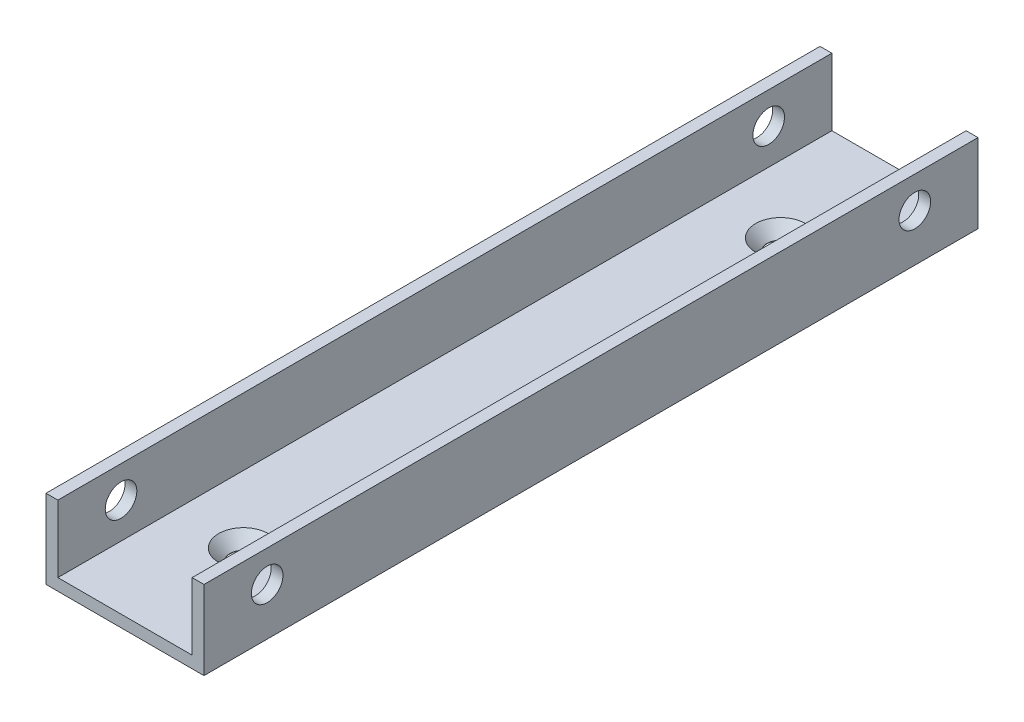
ISO-10303-21;
HEADER;
FILE_DESCRIPTION(('STEP AP214'),'2;1');
FILE_NAME('part.step','',(''),(''),'','','');
FILE_SCHEMA(('AUTOMOTIVE_DESIGN { 1 0 10303 214 1 1 1 1 }'));
ENDSEC;
DATA;
#1=APPLICATION_CONTEXT('core data for automotive mechanical design processes');
#2=APPLICATION_PROTOCOL_DEFINITION('international standard','automotive_design',2000,#1);
#3=PRODUCT_CONTEXT('',#1,'mechanical');
#4=PRODUCT('Part','Part','',(#3));
#5=PRODUCT_RELATED_PRODUCT_CATEGORY('part','',(#4));
#6=PRODUCT_DEFINITION_FORMATION('','',#4);
#7=PRODUCT_DEFINITION_CONTEXT('part definition',#1,'design');
#8=PRODUCT_DEFINITION('design','',#6,#7);
#9=PRODUCT_DEFINITION_SHAPE('','',#8);
#10=(LENGTH_UNIT() NAMED_UNIT(*) SI_UNIT(.MILLI.,.METRE.));
#11=(NAMED_UNIT(*) PLANE_ANGLE_UNIT() SI_UNIT($,.RADIAN.));
#12=(NAMED_UNIT(*) SI_UNIT($,.STERADIAN.) SOLID_ANGLE_UNIT());
#13=UNCERTAINTY_MEASURE_WITH_UNIT(LENGTH_MEASURE(1.E-05),#10,'distance_accuracy_value','');
#14=(GEOMETRIC_REPRESENTATION_CONTEXT(3) GLOBAL_UNCERTAINTY_ASSIGNED_CONTEXT((#13)) GLOBAL_UNIT_ASSIGNED_CONTEXT((#10,
#11,#12)) REPRESENTATION_CONTEXT('',''));
#15=CARTESIAN_POINT('',(0.,0.,0.));
#16=DIRECTION('',(0.,0.,1.));
#17=DIRECTION('',(1.,0.,0.));
#18=AXIS2_PLACEMENT_3D('',#15,#16,#17);
#19=CARTESIAN_POINT('',(-10.,0.,-98.));
#20=DIRECTION('',(-1.,0.,0.));
#21=DIRECTION('',(0.,0.,1.));
#22=AXIS2_PLACEMENT_3D('',#19,#20,#21);
#23=PLANE('',#22);
#24=CARTESIAN_POINT('',(-10.,6.,-90.));
#25=DIRECTION('',(-1.,0.,0.));
#26=DIRECTION('',(0.,0.,1.));
#27=AXIS2_PLACEMENT_3D('',#24,#25,#26);
#28=CIRCLE('',#27,2.);
#29=CARTESIAN_POINT('',(-10.,6.,-88.));
#30=VERTEX_POINT('',#29);
#31=EDGE_CURVE('E202',#30,#30,#28,.T.);
#32=ORIENTED_EDGE('',*,*,#31,.F.);
#33=EDGE_LOOP('',(#32));
#34=FACE_BOUND('',#33,.T.);
#35=CARTESIAN_POINT('',(-10.,6.,-8.00000000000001));
#36=DIRECTION('',(-1.,0.,0.));
#37=DIRECTION('',(0.,0.,1.));
#38=AXIS2_PLACEMENT_3D('',#35,#36,#37);
#39=CIRCLE('',#38,2.);
#40=CARTESIAN_POINT('',(-10.,6.,-6.00000000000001));
#41=VERTEX_POINT('',#40);
#42=EDGE_CURVE('E205',#41,#41,#39,.T.);
#43=ORIENTED_EDGE('',*,*,#42,.F.);
#44=EDGE_LOOP('',(#43));
#45=FACE_BOUND('',#44,.T.);
#46=DIRECTION('',(0.,-1.,0.));
#47=VECTOR('',#46,1.);
#48=CARTESIAN_POINT('',(-10.,0.,0.));
#49=LINE('',#48,#47);
#50=CARTESIAN_POINT('',(-10.,10.,0.));
#51=VERTEX_POINT('',#50);
#52=CARTESIAN_POINT('',(-10.,0.,0.));
#53=VERTEX_POINT('',#52);
#54=EDGE_CURVE('E91',#51,#53,#49,.T.);
#55=ORIENTED_EDGE('',*,*,#54,.F.);
#56=DIRECTION('',(0.,0.,1.));
#57=VECTOR('',#56,1.);
#58=CARTESIAN_POINT('',(-10.,10.,-98.));
#59=LINE('',#58,#57);
#60=CARTESIAN_POINT('',(-10.,10.,-98.));
#61=VERTEX_POINT('',#60);
#62=EDGE_CURVE('E11',#61,#51,#59,.T.);
#63=ORIENTED_EDGE('',*,*,#62,.F.);
#64=DIRECTION('',(0.,-1.,0.));
#65=VECTOR('',#64,1.);
#66=CARTESIAN_POINT('',(-10.,0.,-98.));
#67=LINE('',#66,#65);
#68=CARTESIAN_POINT('',(-10.,0.,-98.));
#69=VERTEX_POINT('',#68);
#70=EDGE_CURVE('E93',#61,#69,#67,.T.);
#71=ORIENTED_EDGE('',*,*,#70,.T.);
#72=DIRECTION('',(0.,0.,1.));
#73=VECTOR('',#72,1.);
#74=CARTESIAN_POINT('',(-10.,0.,-98.));
#75=LINE('',#74,#73);
#76=EDGE_CURVE('E88',#69,#53,#75,.T.);
#77=ORIENTED_EDGE('',*,*,#76,.T.);
#78=EDGE_LOOP('',(#55,#63,#71,#77));
#79=FACE_BOUND('',#78,.T.);
#80=ADVANCED_FACE('F26',(#34,#45,#79),#23,.T.);
#81=CARTESIAN_POINT('',(-10.,10.,-98.));
#82=DIRECTION('',(0.,1.,0.));
#83=DIRECTION('',(0.,0.,1.));
#84=AXIS2_PLACEMENT_3D('',#81,#82,#83);
#85=PLANE('',#84);
#86=DIRECTION('',(-1.,0.,0.));
#87=VECTOR('',#86,1.);
#88=CARTESIAN_POINT('',(-10.,10.,0.));
#89=LINE('',#88,#87);
#90=CARTESIAN_POINT('',(-8.5,10.,0.));
#91=VERTEX_POINT('',#90);
#92=EDGE_CURVE('E110',#91,#51,#89,.T.);
#93=ORIENTED_EDGE('',*,*,#92,.F.);
#94=DIRECTION('',(0.,0.,1.));
#95=VECTOR('',#94,1.);
#96=CARTESIAN_POINT('',(-8.5,10.,-98.));
#97=LINE('',#96,#95);
#98=CARTESIAN_POINT('',(-8.5,10.,-98.));
#99=VERTEX_POINT('',#98);
#100=EDGE_CURVE('E34',#99,#91,#97,.T.);
#101=ORIENTED_EDGE('',*,*,#100,.F.);
#102=DIRECTION('',(-1.,0.,0.));
#103=VECTOR('',#102,1.);
#104=CARTESIAN_POINT('',(-10.,10.,-98.));
#105=LINE('',#104,#103);
#106=EDGE_CURVE('E98',#99,#61,#105,.T.);
#107=ORIENTED_EDGE('',*,*,#106,.T.);
#108=ORIENTED_EDGE('',*,*,#62,.T.);
#109=EDGE_LOOP('',(#93,#101,#107,#108));
#110=FACE_BOUND('',#109,.T.);
#111=ADVANCED_FACE('F177',(#110),#85,.T.);
#112=CARTESIAN_POINT('',(-8.5,1.5,-98.));
#113=DIRECTION('',(1.,0.,0.));
#114=DIRECTION('',(0.,0.,-1.));
#115=AXIS2_PLACEMENT_3D('',#112,#113,#114);
#116=PLANE('',#115);
#117=CARTESIAN_POINT('',(-8.5,6.,-90.));
#118=DIRECTION('',(1.,0.,0.));
#119=DIRECTION('',(0.,0.,-1.));
#120=AXIS2_PLACEMENT_3D('',#117,#118,#119);
#121=CIRCLE('',#120,2.);
#122=CARTESIAN_POINT('',(-8.5,6.,-92.));
#123=VERTEX_POINT('',#122);
#124=EDGE_CURVE('E208',#123,#123,#121,.T.);
#125=ORIENTED_EDGE('',*,*,#124,.F.);
#126=EDGE_LOOP('',(#125));
#127=FACE_BOUND('',#126,.T.);
#128=CARTESIAN_POINT('',(-8.5,6.,-8.00000000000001));
#129=DIRECTION('',(1.,0.,0.));
#130=DIRECTION('',(0.,0.,-1.));
#131=AXIS2_PLACEMENT_3D('',#128,#129,#130);
#132=CIRCLE('',#131,2.);
#133=CARTESIAN_POINT('',(-8.5,6.,-10.));
#134=VERTEX_POINT('',#133);
#135=EDGE_CURVE('E220',#134,#134,#132,.T.);
#136=ORIENTED_EDGE('',*,*,#135,.F.);
#137=EDGE_LOOP('',(#136));
#138=FACE_BOUND('',#137,.T.);
#139=DIRECTION('',(0.,1.,0.));
#140=VECTOR('',#139,1.);
#141=CARTESIAN_POINT('',(-8.5,1.5,0.));
#142=LINE('',#141,#140);
#143=CARTESIAN_POINT('',(-8.5,1.5,0.));
#144=VERTEX_POINT('',#143);
#145=EDGE_CURVE('E128',#144,#91,#142,.T.);
#146=ORIENTED_EDGE('',*,*,#145,.F.);
#147=DIRECTION('',(0.,0.,1.));
#148=VECTOR('',#147,1.);
#149=CARTESIAN_POINT('',(-8.5,1.5,-98.));
#150=LINE('',#149,#148);
#151=CARTESIAN_POINT('',(-8.5,1.5,-98.));
#152=VERTEX_POINT('',#151);
#153=EDGE_CURVE('E150',#152,#144,#150,.T.);
#154=ORIENTED_EDGE('',*,*,#153,.F.);
#155=DIRECTION('',(0.,1.,0.));
#156=VECTOR('',#155,1.);
#157=CARTESIAN_POINT('',(-8.5,1.5,-98.));
#158=LINE('',#157,#156);
#159=EDGE_CURVE('E146',#152,#99,#158,.T.);
#160=ORIENTED_EDGE('',*,*,#159,.T.);
#161=ORIENTED_EDGE('',*,*,#100,.T.);
#162=EDGE_LOOP('',(#146,#154,#160,#161));
#163=FACE_BOUND('',#162,.T.);
#164=ADVANCED_FACE('F176',(#127,#138,#163),#116,.T.);
#165=CARTESIAN_POINT('',(8.5,1.5,-98.));
#166=DIRECTION('',(0.,1.,0.));
#167=DIRECTION('',(0.,0.,1.));
#168=AXIS2_PLACEMENT_3D('',#165,#166,#167);
#169=PLANE('',#168);
#170=CARTESIAN_POINT('',(0.,1.5,-83.));
#171=DIRECTION('',(0.,1.,0.));
#172=DIRECTION('',(0.,0.,1.));
#173=AXIS2_PLACEMENT_3D('',#170,#171,#172);
#174=CIRCLE('',#173,3.15);
#175=CARTESIAN_POINT('',(0.,1.5,-79.85));
#176=VERTEX_POINT('',#175);
#177=EDGE_CURVE('E226',#176,#176,#174,.T.);
#178=ORIENTED_EDGE('',*,*,#177,.F.);
#179=EDGE_LOOP('',(#178));
#180=FACE_BOUND('',#179,.T.);
#181=CARTESIAN_POINT('',(0.,1.5,-15.));
#182=DIRECTION('',(0.,1.,0.));
#183=DIRECTION('',(0.,0.,1.));
#184=AXIS2_PLACEMENT_3D('',#181,#182,#183);
#185=CIRCLE('',#184,3.15);
#186=CARTESIAN_POINT('',(0.,1.5,-11.85));
#187=VERTEX_POINT('',#186);
#188=EDGE_CURVE('E114',#187,#187,#185,.T.);
#189=ORIENTED_EDGE('',*,*,#188,.F.);
#190=EDGE_LOOP('',(#189));
#191=FACE_BOUND('',#190,.T.);
#192=DIRECTION('',(-1.,0.,0.));
#193=VECTOR('',#192,1.);
#194=CARTESIAN_POINT('',(8.5,1.5,0.));
#195=LINE('',#194,#193);
#196=CARTESIAN_POINT('',(8.5,1.5,0.));
#197=VERTEX_POINT('',#196);
#198=EDGE_CURVE('E125',#197,#144,#195,.T.);
#199=ORIENTED_EDGE('',*,*,#198,.F.);
#200=DIRECTION('',(0.,0.,1.));
#201=VECTOR('',#200,1.);
#202=CARTESIAN_POINT('',(8.5,1.5,-98.));
#203=LINE('',#202,#201);
#204=CARTESIAN_POINT('',(8.5,1.5,-98.));
#205=VERTEX_POINT('',#204);
#206=EDGE_CURVE('E152',#205,#197,#203,.T.);
#207=ORIENTED_EDGE('',*,*,#206,.F.);
#208=DIRECTION('',(-1.,0.,0.));
#209=VECTOR('',#208,1.);
#210=CARTESIAN_POINT('',(8.5,1.5,-98.));
#211=LINE('',#210,#209);
#212=EDGE_CURVE('E143',#205,#152,#211,.T.);
#213=ORIENTED_EDGE('',*,*,#212,.T.);
#214=ORIENTED_EDGE('',*,*,#153,.T.);
#215=EDGE_LOOP('',(#199,#207,#213,#214));
#216=FACE_BOUND('',#215,.T.);
#217=ADVANCED_FACE('F172',(#180,#191,#216),#169,.T.);
#218=CARTESIAN_POINT('',(8.5,1.5,-98.));
#219=DIRECTION('',(-1.,0.,0.));
#220=DIRECTION('',(0.,0.,1.));
#221=AXIS2_PLACEMENT_3D('',#218,#219,#220);
#222=PLANE('',#221);
#223=CARTESIAN_POINT('',(8.5,6.,-90.));
#224=DIRECTION('',(-1.,0.,0.));
#225=DIRECTION('',(0.,0.,1.));
#226=AXIS2_PLACEMENT_3D('',#223,#224,#225);
#227=CIRCLE('',#226,2.);
#228=CARTESIAN_POINT('',(8.5,6.,-88.));
#229=VERTEX_POINT('',#228);
#230=EDGE_CURVE('E214',#229,#229,#227,.T.);
#231=ORIENTED_EDGE('',*,*,#230,.F.);
#232=EDGE_LOOP('',(#231));
#233=FACE_BOUND('',#232,.T.);
#234=CARTESIAN_POINT('',(8.5,6.,-8.00000000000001));
#235=DIRECTION('',(-1.,0.,0.));
#236=DIRECTION('',(0.,0.,1.));
#237=AXIS2_PLACEMENT_3D('',#234,#235,#236);
#238=CIRCLE('',#237,2.);
#239=CARTESIAN_POINT('',(8.5,6.,-6.00000000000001));
#240=VERTEX_POINT('',#239);
#241=EDGE_CURVE('E211',#240,#240,#238,.T.);
#242=ORIENTED_EDGE('',*,*,#241,.F.);
#243=EDGE_LOOP('',(#242));
#244=FACE_BOUND('',#243,.T.);
#245=DIRECTION('',(0.,-1.,0.));
#246=VECTOR('',#245,1.);
#247=CARTESIAN_POINT('',(8.5,1.5,0.));
#248=LINE('',#247,#246);
#249=CARTESIAN_POINT('',(8.5,10.,0.));
#250=VERTEX_POINT('',#249);
#251=EDGE_CURVE('E122',#250,#197,#248,.T.);
#252=ORIENTED_EDGE('',*,*,#251,.F.);
#253=DIRECTION('',(0.,0.,1.));
#254=VECTOR('',#253,1.);
#255=CARTESIAN_POINT('',(8.5,10.,-98.));
#256=LINE('',#255,#254);
#257=CARTESIAN_POINT('',(8.5,10.,-98.));
#258=VERTEX_POINT('',#257);
#259=EDGE_CURVE('E154',#258,#250,#256,.T.);
#260=ORIENTED_EDGE('',*,*,#259,.F.);
#261=DIRECTION('',(0.,-1.,0.));
#262=VECTOR('',#261,1.);
#263=CARTESIAN_POINT('',(8.5,1.5,-98.));
#264=LINE('',#263,#262);
#265=EDGE_CURVE('E140',#258,#205,#264,.T.);
#266=ORIENTED_EDGE('',*,*,#265,.T.);
#267=ORIENTED_EDGE('',*,*,#206,.T.);
#268=EDGE_LOOP('',(#252,#260,#266,#267));
#269=FACE_BOUND('',#268,.T.);
#270=ADVANCED_FACE('F168',(#233,#244,#269),#222,.T.);
#271=CARTESIAN_POINT('',(10.,10.,-98.));
#272=DIRECTION('',(0.,1.,0.));
#273=DIRECTION('',(0.,0.,1.));
#274=AXIS2_PLACEMENT_3D('',#271,#272,#273);
#275=PLANE('',#274);
#276=DIRECTION('',(-1.,0.,0.));
#277=VECTOR('',#276,1.);
#278=CARTESIAN_POINT('',(10.,10.,0.));
#279=LINE('',#278,#277);
#280=CARTESIAN_POINT('',(10.,10.,0.));
#281=VERTEX_POINT('',#280);
#282=EDGE_CURVE('E119',#281,#250,#279,.T.);
#283=ORIENTED_EDGE('',*,*,#282,.F.);
#284=DIRECTION('',(0.,0.,1.));
#285=VECTOR('',#284,1.);
#286=CARTESIAN_POINT('',(10.,10.,-98.));
#287=LINE('',#286,#285);
#288=CARTESIAN_POINT('',(10.,10.,-98.));
#289=VERTEX_POINT('',#288);
#290=EDGE_CURVE('E156',#289,#281,#287,.T.);
#291=ORIENTED_EDGE('',*,*,#290,.F.);
#292=DIRECTION('',(-1.,0.,0.));
#293=VECTOR('',#292,1.);
#294=CARTESIAN_POINT('',(10.,10.,-98.));
#295=LINE('',#294,#293);
#296=EDGE_CURVE('E137',#289,#258,#295,.T.);
#297=ORIENTED_EDGE('',*,*,#296,.T.);
#298=ORIENTED_EDGE('',*,*,#259,.T.);
#299=EDGE_LOOP('',(#283,#291,#297,#298));
#300=FACE_BOUND('',#299,.T.);
#301=ADVANCED_FACE('F164',(#300),#275,.T.);
#302=CARTESIAN_POINT('',(10.,0.,-98.));
#303=DIRECTION('',(1.,0.,0.));
#304=DIRECTION('',(0.,0.,-1.));
#305=AXIS2_PLACEMENT_3D('',#302,#303,#304);
#306=PLANE('',#305);
#307=CARTESIAN_POINT('',(10.,6.,-90.));
#308=DIRECTION('',(-1.,0.,0.));
#309=DIRECTION('',(0.,0.,1.));
#310=AXIS2_PLACEMENT_3D('',#307,#308,#309);
#311=CIRCLE('',#310,2.);
#312=CARTESIAN_POINT('',(10.,6.,-88.));
#313=VERTEX_POINT('',#312);
#314=EDGE_CURVE('E275',#313,#313,#311,.T.);
#315=ORIENTED_EDGE('',*,*,#314,.T.);
#316=EDGE_LOOP('',(#315));
#317=FACE_BOUND('',#316,.T.);
#318=CARTESIAN_POINT('',(10.,6.,-8.00000000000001));
#319=DIRECTION('',(-1.,0.,0.));
#320=DIRECTION('',(0.,0.,1.));
#321=AXIS2_PLACEMENT_3D('',#318,#319,#320);
#322=CIRCLE('',#321,2.);
#323=CARTESIAN_POINT('',(10.,6.,-6.00000000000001));
#324=VERTEX_POINT('',#323);
#325=EDGE_CURVE('E207',#324,#324,#322,.T.);
#326=ORIENTED_EDGE('',*,*,#325,.T.);
#327=EDGE_LOOP('',(#326));
#328=FACE_BOUND('',#327,.T.);
#329=DIRECTION('',(0.,1.,0.));
#330=VECTOR('',#329,1.);
#331=CARTESIAN_POINT('',(10.,0.,0.));
#332=LINE('',#331,#330);
#333=CARTESIAN_POINT('',(10.,0.,0.));
#334=VERTEX_POINT('',#333);
#335=EDGE_CURVE('E106',#334,#281,#332,.T.);
#336=ORIENTED_EDGE('',*,*,#335,.F.);
#337=DIRECTION('',(0.,0.,1.));
#338=VECTOR('',#337,1.);
#339=CARTESIAN_POINT('',(10.,0.,-98.));
#340=LINE('',#339,#338);
#341=CARTESIAN_POINT('',(10.,0.,-98.));
#342=VERTEX_POINT('',#341);
#343=EDGE_CURVE('E97',#342,#334,#340,.T.);
#344=ORIENTED_EDGE('',*,*,#343,.F.);
#345=DIRECTION('',(0.,1.,0.));
#346=VECTOR('',#345,1.);
#347=CARTESIAN_POINT('',(10.,0.,-98.));
#348=LINE('',#347,#346);
#349=EDGE_CURVE('E134',#342,#289,#348,.T.);
#350=ORIENTED_EDGE('',*,*,#349,.T.);
#351=ORIENTED_EDGE('',*,*,#290,.T.);
#352=EDGE_LOOP('',(#336,#344,#350,#351));
#353=FACE_BOUND('',#352,.T.);
#354=ADVANCED_FACE('F160',(#317,#328,#353),#306,.T.);
#355=CARTESIAN_POINT('',(10.,0.,-98.));
#356=DIRECTION('',(0.,-1.,0.));
#357=DIRECTION('',(0.,0.,-1.));
#358=AXIS2_PLACEMENT_3D('',#355,#356,#357);
#359=PLANE('',#358);
#360=CARTESIAN_POINT('',(0.,0.,-83.));
#361=DIRECTION('',(0.,-1.,0.));
#362=DIRECTION('',(0.,0.,-1.));
#363=AXIS2_PLACEMENT_3D('',#360,#361,#362);
#364=CIRCLE('',#363,1.69999999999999);
#365=CARTESIAN_POINT('',(0.,0.,-84.7));
#366=VERTEX_POINT('',#365);
#367=EDGE_CURVE('E29',#366,#366,#364,.T.);
#368=ORIENTED_EDGE('',*,*,#367,.F.);
#369=EDGE_LOOP('',(#368));
#370=FACE_BOUND('',#369,.T.);
#371=CARTESIAN_POINT('',(0.,0.,-15.));
#372=DIRECTION('',(0.,-1.,0.));
#373=DIRECTION('',(0.,0.,-1.));
#374=AXIS2_PLACEMENT_3D('',#371,#372,#373);
#375=CIRCLE('',#374,1.69999999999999);
#376=CARTESIAN_POINT('',(0.,0.,-16.7));
#377=VERTEX_POINT('',#376);
#378=EDGE_CURVE('E111',#377,#377,#375,.T.);
#379=ORIENTED_EDGE('',*,*,#378,.F.);
#380=EDGE_LOOP('',(#379));
#381=FACE_BOUND('',#380,.T.);
#382=DIRECTION('',(1.,0.,0.));
#383=VECTOR('',#382,1.);
#384=CARTESIAN_POINT('',(10.,0.,0.));
#385=LINE('',#384,#383);
#386=EDGE_CURVE('E101',#53,#334,#385,.T.);
#387=ORIENTED_EDGE('',*,*,#386,.F.);
#388=ORIENTED_EDGE('',*,*,#76,.F.);
#389=DIRECTION('',(1.,0.,0.));
#390=VECTOR('',#389,1.);
#391=CARTESIAN_POINT('',(10.,0.,-98.));
#392=LINE('',#391,#390);
#393=EDGE_CURVE('E132',#69,#342,#392,.T.);
#394=ORIENTED_EDGE('',*,*,#393,.T.);
#395=ORIENTED_EDGE('',*,*,#343,.T.);
#396=EDGE_LOOP('',(#387,#388,#394,#395));
#397=FACE_BOUND('',#396,.T.);
#398=ADVANCED_FACE('F102',(#370,#381,#397),#359,.T.);
#399=CARTESIAN_POINT('',(-10.,10.,-98.));
#400=DIRECTION('',(0.,0.,-1.));
#401=DIRECTION('',(-1.,0.,0.));
#402=AXIS2_PLACEMENT_3D('',#399,#400,#401);
#403=PLANE('',#402);
#404=ORIENTED_EDGE('',*,*,#70,.F.);
#405=ORIENTED_EDGE('',*,*,#106,.F.);
#406=ORIENTED_EDGE('',*,*,#159,.F.);
#407=ORIENTED_EDGE('',*,*,#212,.F.);
#408=ORIENTED_EDGE('',*,*,#265,.F.);
#409=ORIENTED_EDGE('',*,*,#296,.F.);
#410=ORIENTED_EDGE('',*,*,#349,.F.);
#411=ORIENTED_EDGE('',*,*,#393,.F.);
#412=EDGE_LOOP('',(#404,#405,#406,#407,#408,#409,#410,#411));
#413=FACE_BOUND('',#412,.T.);
#414=ADVANCED_FACE('F180',(#413),#403,.T.);
#415=CARTESIAN_POINT('',(-10.,10.,0.));
#416=DIRECTION('',(0.,0.,-1.));
#417=DIRECTION('',(-1.,0.,0.));
#418=AXIS2_PLACEMENT_3D('',#415,#416,#417);
#419=PLANE('',#418);
#420=ORIENTED_EDGE('',*,*,#54,.T.);
#421=ORIENTED_EDGE('',*,*,#386,.T.);
#422=ORIENTED_EDGE('',*,*,#335,.T.);
#423=ORIENTED_EDGE('',*,*,#282,.T.);
#424=ORIENTED_EDGE('',*,*,#251,.T.);
#425=ORIENTED_EDGE('',*,*,#198,.T.);
#426=ORIENTED_EDGE('',*,*,#145,.T.);
#427=ORIENTED_EDGE('',*,*,#92,.T.);
#428=EDGE_LOOP('',(#420,#421,#422,#423,#424,#425,#426,#427));
#429=FACE_BOUND('',#428,.T.);
#430=ADVANCED_FACE('F108',(#429),#419,.F.);
#431=CARTESIAN_POINT('',(0.,1.5,-15.));
#432=DIRECTION('',(0.,1.,0.));
#433=DIRECTION('',(0.,0.,1.));
#434=AXIS2_PLACEMENT_3D('',#431,#432,#433);
#435=CONICAL_SURFACE('',#434,3.15,0.785398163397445);
#436=CARTESIAN_POINT('',(0.,0.0499999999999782,-15.));
#437=DIRECTION('',(0.,1.,0.));
#438=DIRECTION('',(0.,0.,1.));
#439=AXIS2_PLACEMENT_3D('',#436,#437,#438);
#440=CIRCLE('',#439,1.69999999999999);
#441=CARTESIAN_POINT('',(0.,0.0499999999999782,-13.3));
#442=VERTEX_POINT('',#441);
#443=EDGE_CURVE('E228',#442,#442,#440,.T.);
#444=ORIENTED_EDGE('',*,*,#443,.F.);
#445=EDGE_LOOP('',(#444));
#446=FACE_BOUND('',#445,.T.);
#447=ORIENTED_EDGE('',*,*,#188,.T.);
#448=EDGE_LOOP('',(#447));
#449=FACE_BOUND('',#448,.T.);
#450=ADVANCED_FACE('F187',(#446,#449),#435,.F.);
#451=CARTESIAN_POINT('',(0.,1.5,-15.));
#452=DIRECTION('',(0.,1.,0.));
#453=DIRECTION('',(0.,0.,1.));
#454=AXIS2_PLACEMENT_3D('',#451,#452,#453);
#455=CYLINDRICAL_SURFACE('',#454,1.69999999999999);
#456=ORIENTED_EDGE('',*,*,#378,.T.);
#457=EDGE_LOOP('',(#456));
#458=FACE_BOUND('',#457,.T.);
#459=ORIENTED_EDGE('',*,*,#443,.T.);
#460=EDGE_LOOP('',(#459));
#461=FACE_BOUND('',#460,.T.);
#462=ADVANCED_FACE('F241',(#458,#461),#455,.F.);
#463=CARTESIAN_POINT('',(0.,1.5,-83.));
#464=DIRECTION('',(0.,1.,0.));
#465=DIRECTION('',(0.,0.,1.));
#466=AXIS2_PLACEMENT_3D('',#463,#464,#465);
#467=CONICAL_SURFACE('',#466,3.15,0.785398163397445);
#468=CARTESIAN_POINT('',(0.,0.0499999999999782,-83.));
#469=DIRECTION('',(0.,1.,0.));
#470=DIRECTION('',(0.,0.,1.));
#471=AXIS2_PLACEMENT_3D('',#468,#469,#470);
#472=CIRCLE('',#471,1.69999999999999);
#473=CARTESIAN_POINT('',(0.,0.0499999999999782,-81.3));
#474=VERTEX_POINT('',#473);
#475=EDGE_CURVE('E223',#474,#474,#472,.T.);
#476=ORIENTED_EDGE('',*,*,#475,.F.);
#477=EDGE_LOOP('',(#476));
#478=FACE_BOUND('',#477,.T.);
#479=ORIENTED_EDGE('',*,*,#177,.T.);
#480=EDGE_LOOP('',(#479));
#481=FACE_BOUND('',#480,.T.);
#482=ADVANCED_FACE('F243',(#478,#481),#467,.F.);
#483=CARTESIAN_POINT('',(0.,1.5,-83.));
#484=DIRECTION('',(0.,1.,0.));
#485=DIRECTION('',(0.,0.,1.));
#486=AXIS2_PLACEMENT_3D('',#483,#484,#485);
#487=CYLINDRICAL_SURFACE('',#486,1.69999999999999);
#488=ORIENTED_EDGE('',*,*,#367,.T.);
#489=EDGE_LOOP('',(#488));
#490=FACE_BOUND('',#489,.T.);
#491=ORIENTED_EDGE('',*,*,#475,.T.);
#492=EDGE_LOOP('',(#491));
#493=FACE_BOUND('',#492,.T.);
#494=ADVANCED_FACE('F236',(#490,#493),#487,.F.);
#495=CARTESIAN_POINT('',(10.,6.,-8.00000000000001));
#496=DIRECTION('',(-1.,0.,0.));
#497=DIRECTION('',(0.,0.,1.));
#498=AXIS2_PLACEMENT_3D('',#495,#496,#497);
#499=CYLINDRICAL_SURFACE('',#498,2.);
#500=ORIENTED_EDGE('',*,*,#241,.T.);
#501=EDGE_LOOP('',(#500));
#502=FACE_BOUND('',#501,.T.);
#503=ORIENTED_EDGE('',*,*,#325,.F.);
#504=EDGE_LOOP('',(#503));
#505=FACE_BOUND('',#504,.T.);
#506=ADVANCED_FACE('F255',(#502,#505),#499,.F.);
#507=ORIENTED_EDGE('',*,*,#135,.T.);
#508=EDGE_LOOP('',(#507));
#509=FACE_BOUND('',#508,.T.);
#510=ORIENTED_EDGE('',*,*,#42,.T.);
#511=EDGE_LOOP('',(#510));
#512=FACE_BOUND('',#511,.T.);
#513=ADVANCED_FACE('F258',(#509,#512),#499,.F.);
#514=CARTESIAN_POINT('',(10.,6.,-90.));
#515=DIRECTION('',(-1.,0.,0.));
#516=DIRECTION('',(0.,0.,1.));
#517=AXIS2_PLACEMENT_3D('',#514,#515,#516);
#518=CYLINDRICAL_SURFACE('',#517,2.);
#519=ORIENTED_EDGE('',*,*,#230,.T.);
#520=EDGE_LOOP('',(#519));
#521=FACE_BOUND('',#520,.T.);
#522=ORIENTED_EDGE('',*,*,#314,.F.);
#523=EDGE_LOOP('',(#522));
#524=FACE_BOUND('',#523,.T.);
#525=ADVANCED_FACE('F260',(#521,#524),#518,.F.);
#526=ORIENTED_EDGE('',*,*,#124,.T.);
#527=EDGE_LOOP('',(#526));
#528=FACE_BOUND('',#527,.T.);
#529=ORIENTED_EDGE('',*,*,#31,.T.);
#530=EDGE_LOOP('',(#529));
#531=FACE_BOUND('',#530,.T.);
#532=ADVANCED_FACE('F262',(#528,#531),#518,.F.);
#533=CLOSED_SHELL('',(#80,#111,#164,#217,#270,#301,#354,#398,#414,#430,#450,#462,#482,#494,#506,
#513,#525,#532));
#534=MANIFOLD_SOLID_BREP('B2',#533);
#535=ADVANCED_BREP_SHAPE_REPRESENTATION('',(#18,#534),#14);
#536=SHAPE_DEFINITION_REPRESENTATION(#9,#535);
ENDSEC;
END-ISO-10303-21;
